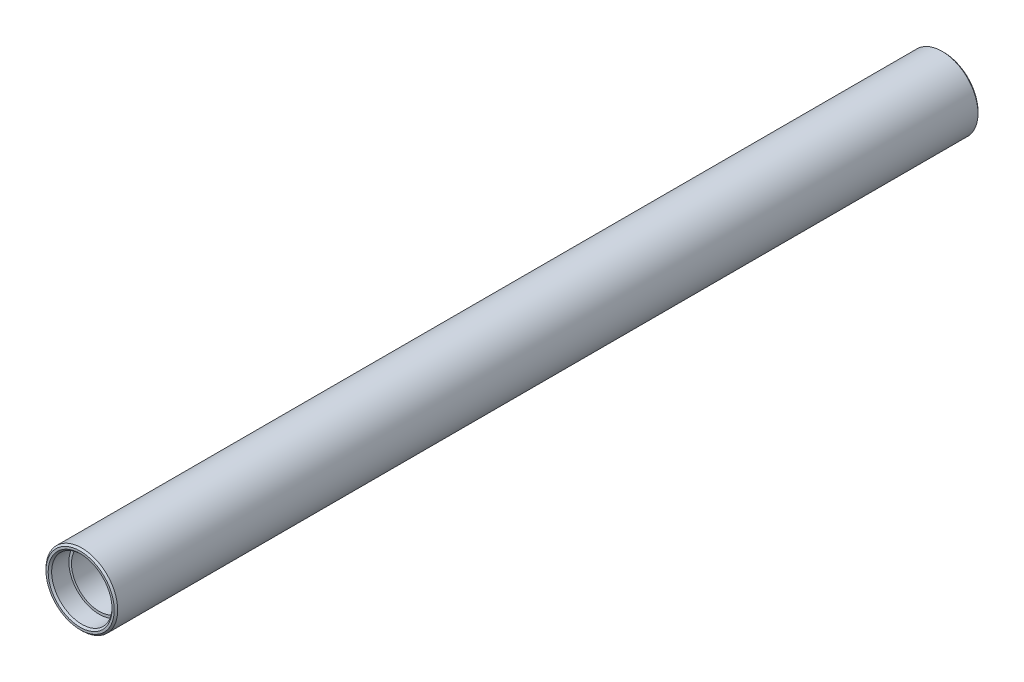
from build123d import *

# Parameters (mm, degrees)
ESQUISSE1_R                  = 20.75
ESQUISSE1_R_2                = 16
EXTRUSION1_DEPTH             = 250
ESQUISSE2_R                  = 17.5
ENL_V_MAT_EXTRU_1_DEPTH      = 11
CHANFREIN1_SIZE              = 1
CHANFREIN1_OF_SYM_TRIE1_SIZE = 1


with BuildPart() as part:
    # Esquisse1 → Extrusion1 (new body)
    with BuildSketch(Plane.XY):
        Circle(ESQUISSE1_R)
        Circle(ESQUISSE1_R_2, mode=Mode.SUBTRACT)
    extrusion1 = extrude(amount=EXTRUSION1_DEPTH)

    # Esquisse2 → Enl_v. mat.-Extru.1 (cut)
    with BuildSketch(Plane(origin=(0, 0, 0), x_dir=(-1, 0, 0), z_dir=(0, 0, -1))):
        Circle(ESQUISSE2_R)
    enl_v_mat_extru_1 = extrude(amount=-ENL_V_MAT_EXTRU_1_DEPTH, mode=Mode.SUBTRACT)

    # Chanfrein1
    chanfrein1_edges = [part.edges().sort_by_distance(p)[0] for p in [
        (17.5, 0, 0),
        (-20.75, 0, 0),
    ]]
    chamfer(chanfrein1_edges, length=CHANFREIN1_SIZE)

    # Sym_trie1: Extrusion1, Enl_v. mat.-Extru.1 across plane
    add(extrusion1.mirror(Plane.XY.offset(250)))
    add(enl_v_mat_extru_1.mirror(Plane.XY.offset(250)), mode=Mode.SUBTRACT)

    # Chanfrein1 of Sym_trie1
    chanfrein1_of_sym_trie1_edges = [part.edges().sort_by_distance(p)[0] for p in [
        (17.5, 0, 500),
        (-20.75, 0, 500),
    ]]
    chamfer(chanfrein1_of_sym_trie1_edges, length=CHANFREIN1_OF_SYM_TRIE1_SIZE)


solid = part.part
